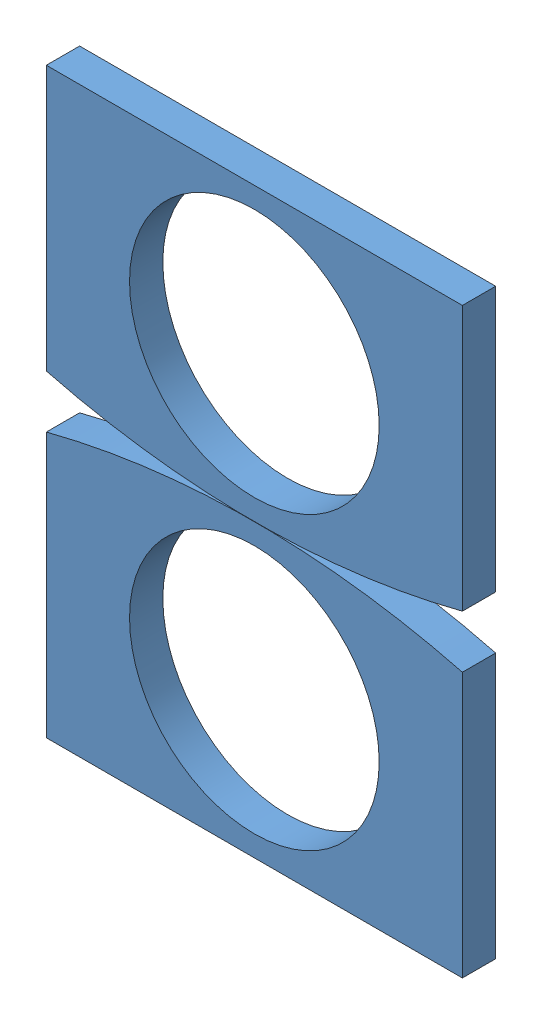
SolidWorks assembly two plates.SLDASM, configuration Default (file format 3400). Lengths in mm.
Overall size (50 70 4).
2 component instances, 1 part files, 3 mates.
Components (placement in the parent):
- plate-1: plate.SLDPRT [Default] at origin size (50 35 4)
- plate-2: plate.SLDPRT [Default] at (0 0 4) x (1 0 0) z (0 0 -1) size (50 35 4)
Mates (geometry in assembly coordinates):
- Coincident1: coincident aligned: plane of plate-1 through (0 100 4) normal (0 0 1); plane of plate-2 through (0 -100 4) normal (0 0 1)
- Coincident2: coincident aligned: plane of plate-1 through (25 3.1754 4) normal (1 0 0); plane of plate-2 through (25 -3.1754 0) normal (1 0 0)
- Tangent1: tangent anti-aligned: cylinder of plate-1; unknown of plate-2
